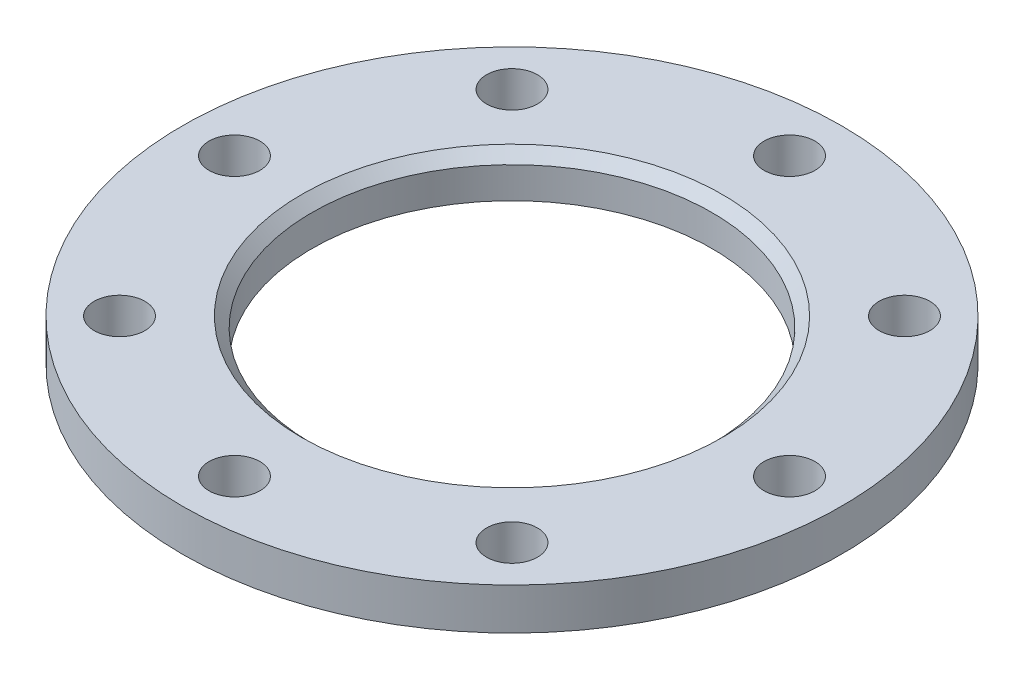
ISO-10303-21;
HEADER;
FILE_DESCRIPTION(('STEP AP214'),'2;1');
FILE_NAME('part.step','',(''),(''),'','','');
FILE_SCHEMA(('AUTOMOTIVE_DESIGN { 1 0 10303 214 1 1 1 1 }'));
ENDSEC;
DATA;
#1=APPLICATION_CONTEXT('core data for automotive mechanical design processes');
#2=APPLICATION_PROTOCOL_DEFINITION('international standard','automotive_design',2000,#1);
#3=PRODUCT_CONTEXT('',#1,'mechanical');
#4=PRODUCT('Part','Part','',(#3));
#5=PRODUCT_RELATED_PRODUCT_CATEGORY('part','',(#4));
#6=PRODUCT_DEFINITION_FORMATION('','',#4);
#7=PRODUCT_DEFINITION_CONTEXT('part definition',#1,'design');
#8=PRODUCT_DEFINITION('design','',#6,#7);
#9=PRODUCT_DEFINITION_SHAPE('','',#8);
#10=(LENGTH_UNIT() NAMED_UNIT(*) SI_UNIT(.MILLI.,.METRE.));
#11=(NAMED_UNIT(*) PLANE_ANGLE_UNIT() SI_UNIT($,.RADIAN.));
#12=(NAMED_UNIT(*) SI_UNIT($,.STERADIAN.) SOLID_ANGLE_UNIT());
#13=UNCERTAINTY_MEASURE_WITH_UNIT(LENGTH_MEASURE(1.E-05),#10,'distance_accuracy_value','');
#14=(GEOMETRIC_REPRESENTATION_CONTEXT(3) GLOBAL_UNCERTAINTY_ASSIGNED_CONTEXT((#13)) GLOBAL_UNIT_ASSIGNED_CONTEXT((#10,
#11,#12)) REPRESENTATION_CONTEXT('',''));
#15=CARTESIAN_POINT('',(0.,0.,0.));
#16=DIRECTION('',(0.,0.,1.));
#17=DIRECTION('',(1.,0.,0.));
#18=AXIS2_PLACEMENT_3D('',#15,#16,#17);
#19=CARTESIAN_POINT('',(116.75,18.,0.));
#20=DIRECTION('',(0.,1.,0.));
#21=DIRECTION('',(0.,0.,1.));
#22=AXIS2_PLACEMENT_3D('',#19,#20,#21);
#23=PLANE('',#22);
#24=CARTESIAN_POINT('',(0.,18.,0.));
#25=DIRECTION('',(0.,1.,0.));
#26=DIRECTION('',(0.,0.,1.));
#27=AXIS2_PLACEMENT_3D('',#24,#25,#26);
#28=CIRCLE('',#27,91.);
#29=CARTESIAN_POINT('',(0.,18.,91.));
#30=VERTEX_POINT('',#29);
#31=EDGE_CURVE('E16',#30,#30,#28,.F.);
#32=ORIENTED_EDGE('',*,*,#31,.T.);
#33=EDGE_LOOP('',(#32));
#34=FACE_BOUND('',#33,.T.);
#35=CARTESIAN_POINT('',(120.,18.,0.));
#36=DIRECTION('',(0.,-1.,0.));
#37=DIRECTION('',(0.,0.,-1.));
#38=AXIS2_PLACEMENT_3D('',#35,#36,#37);
#39=CIRCLE('',#38,11.);
#40=CARTESIAN_POINT('',(120.,18.,-11.));
#41=VERTEX_POINT('',#40);
#42=EDGE_CURVE('E53',#41,#41,#39,.T.);
#43=ORIENTED_EDGE('',*,*,#42,.T.);
#44=EDGE_LOOP('',(#43));
#45=FACE_BOUND('',#44,.T.);
#46=CARTESIAN_POINT('',(84.8528137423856,18.,84.8528137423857));
#47=DIRECTION('',(0.,-1.,0.));
#48=DIRECTION('',(0.,0.,-1.));
#49=AXIS2_PLACEMENT_3D('',#46,#47,#48);
#50=CIRCLE('',#49,11.);
#51=CARTESIAN_POINT('',(84.8528137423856,18.,73.8528137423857));
#52=VERTEX_POINT('',#51);
#53=EDGE_CURVE('E56',#52,#52,#50,.T.);
#54=ORIENTED_EDGE('',*,*,#53,.T.);
#55=EDGE_LOOP('',(#54));
#56=FACE_BOUND('',#55,.T.);
#57=CARTESIAN_POINT('',(0.,18.,120.));
#58=DIRECTION('',(0.,-1.,0.));
#59=DIRECTION('',(0.,0.,-1.));
#60=AXIS2_PLACEMENT_3D('',#57,#58,#59);
#61=CIRCLE('',#60,11.);
#62=CARTESIAN_POINT('',(0.,18.,109.));
#63=VERTEX_POINT('',#62);
#64=EDGE_CURVE('E59',#63,#63,#61,.T.);
#65=ORIENTED_EDGE('',*,*,#64,.T.);
#66=EDGE_LOOP('',(#65));
#67=FACE_BOUND('',#66,.T.);
#68=CARTESIAN_POINT('',(-84.8528137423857,18.,84.8528137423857));
#69=DIRECTION('',(0.,-1.,0.));
#70=DIRECTION('',(0.,0.,-1.));
#71=AXIS2_PLACEMENT_3D('',#68,#69,#70);
#72=CIRCLE('',#71,11.);
#73=CARTESIAN_POINT('',(-84.8528137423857,18.,73.8528137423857));
#74=VERTEX_POINT('',#73);
#75=EDGE_CURVE('E62',#74,#74,#72,.T.);
#76=ORIENTED_EDGE('',*,*,#75,.T.);
#77=EDGE_LOOP('',(#76));
#78=FACE_BOUND('',#77,.T.);
#79=CARTESIAN_POINT('',(-120.,18.,0.));
#80=DIRECTION('',(0.,-1.,0.));
#81=DIRECTION('',(0.,0.,-1.));
#82=AXIS2_PLACEMENT_3D('',#79,#80,#81);
#83=CIRCLE('',#82,11.);
#84=CARTESIAN_POINT('',(-120.,18.,-11.));
#85=VERTEX_POINT('',#84);
#86=EDGE_CURVE('E65',#85,#85,#83,.T.);
#87=ORIENTED_EDGE('',*,*,#86,.T.);
#88=EDGE_LOOP('',(#87));
#89=FACE_BOUND('',#88,.T.);
#90=CARTESIAN_POINT('',(-84.8528137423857,18.,-84.8528137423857));
#91=DIRECTION('',(0.,-1.,0.));
#92=DIRECTION('',(0.,0.,-1.));
#93=AXIS2_PLACEMENT_3D('',#90,#91,#92);
#94=CIRCLE('',#93,11.);
#95=CARTESIAN_POINT('',(-84.8528137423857,18.,-95.8528137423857));
#96=VERTEX_POINT('',#95);
#97=EDGE_CURVE('E68',#96,#96,#94,.T.);
#98=ORIENTED_EDGE('',*,*,#97,.T.);
#99=EDGE_LOOP('',(#98));
#100=FACE_BOUND('',#99,.T.);
#101=CARTESIAN_POINT('',(0.,18.,-120.));
#102=DIRECTION('',(0.,-1.,0.));
#103=DIRECTION('',(0.,0.,-1.));
#104=AXIS2_PLACEMENT_3D('',#101,#102,#103);
#105=CIRCLE('',#104,11.);
#106=CARTESIAN_POINT('',(0.,18.,-131.));
#107=VERTEX_POINT('',#106);
#108=EDGE_CURVE('E71',#107,#107,#105,.T.);
#109=ORIENTED_EDGE('',*,*,#108,.T.);
#110=EDGE_LOOP('',(#109));
#111=FACE_BOUND('',#110,.T.);
#112=CARTESIAN_POINT('',(84.8528137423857,18.,-84.8528137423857));
#113=DIRECTION('',(0.,-1.,0.));
#114=DIRECTION('',(0.,0.,-1.));
#115=AXIS2_PLACEMENT_3D('',#112,#113,#114);
#116=CIRCLE('',#115,11.);
#117=CARTESIAN_POINT('',(84.8528137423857,18.,-95.8528137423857));
#118=VERTEX_POINT('',#117);
#119=EDGE_CURVE('E74',#118,#118,#116,.T.);
#120=ORIENTED_EDGE('',*,*,#119,.T.);
#121=EDGE_LOOP('',(#120));
#122=FACE_BOUND('',#121,.T.);
#123=CARTESIAN_POINT('',(0.,18.,0.));
#124=DIRECTION('',(0.,1.,0.));
#125=DIRECTION('',(0.,0.,1.));
#126=AXIS2_PLACEMENT_3D('',#123,#124,#125);
#127=CIRCLE('',#126,142.5);
#128=CARTESIAN_POINT('',(0.,18.,142.5));
#129=VERTEX_POINT('',#128);
#130=EDGE_CURVE('E76',#129,#129,#127,.F.);
#131=ORIENTED_EDGE('',*,*,#130,.F.);
#132=EDGE_LOOP('',(#131));
#133=FACE_BOUND('',#132,.T.);
#134=ADVANCED_FACE('F13',(#34,#45,#56,#67,#78,#89,#100,#111,#122,#133),#23,.T.);
#135=CARTESIAN_POINT('',(0.,18.,0.));
#136=DIRECTION('',(0.,1.,0.));
#137=DIRECTION('',(0.,0.,1.));
#138=AXIS2_PLACEMENT_3D('',#135,#136,#137);
#139=CONICAL_SURFACE('',#138,91.,0.785398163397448);
#140=ORIENTED_EDGE('',*,*,#31,.F.);
#141=EDGE_LOOP('',(#140));
#142=FACE_BOUND('',#141,.T.);
#143=CARTESIAN_POINT('',(0.,13.5,0.));
#144=DIRECTION('',(0.,1.,0.));
#145=DIRECTION('',(0.,0.,1.));
#146=AXIS2_PLACEMENT_3D('',#143,#144,#145);
#147=CIRCLE('',#146,86.5);
#148=CARTESIAN_POINT('',(0.,13.5,86.5));
#149=VERTEX_POINT('',#148);
#150=EDGE_CURVE('E28',#149,#149,#147,.F.);
#151=ORIENTED_EDGE('',*,*,#150,.T.);
#152=EDGE_LOOP('',(#151));
#153=FACE_BOUND('',#152,.T.);
#154=ADVANCED_FACE('F85',(#142,#153),#139,.F.);
#155=CARTESIAN_POINT('',(0.,9.,0.));
#156=DIRECTION('',(0.,1.,0.));
#157=DIRECTION('',(0.,0.,1.));
#158=AXIS2_PLACEMENT_3D('',#155,#156,#157);
#159=CYLINDRICAL_SURFACE('',#158,142.5);
#160=CARTESIAN_POINT('',(0.,0.,0.));
#161=DIRECTION('',(0.,1.,0.));
#162=DIRECTION('',(0.,0.,1.));
#163=AXIS2_PLACEMENT_3D('',#160,#161,#162);
#164=CIRCLE('',#163,142.5);
#165=CARTESIAN_POINT('',(0.,0.,142.5));
#166=VERTEX_POINT('',#165);
#167=EDGE_CURVE('E50',#166,#166,#164,.F.);
#168=ORIENTED_EDGE('',*,*,#167,.F.);
#169=EDGE_LOOP('',(#168));
#170=FACE_BOUND('',#169,.T.);
#171=ORIENTED_EDGE('',*,*,#130,.T.);
#172=EDGE_LOOP('',(#171));
#173=FACE_BOUND('',#172,.T.);
#174=ADVANCED_FACE('F88',(#170,#173),#159,.T.);
#175=CARTESIAN_POINT('',(84.8528137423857,18.,-84.8528137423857));
#176=DIRECTION('',(0.,-1.,0.));
#177=DIRECTION('',(0.,0.,-1.));
#178=AXIS2_PLACEMENT_3D('',#175,#176,#177);
#179=CYLINDRICAL_SURFACE('',#178,11.);
#180=ORIENTED_EDGE('',*,*,#119,.F.);
#181=EDGE_LOOP('',(#180));
#182=FACE_BOUND('',#181,.T.);
#183=CARTESIAN_POINT('',(84.8528137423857,0.,-84.8528137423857));
#184=DIRECTION('',(0.,-1.,0.));
#185=DIRECTION('',(0.,0.,-1.));
#186=AXIS2_PLACEMENT_3D('',#183,#184,#185);
#187=CIRCLE('',#186,11.);
#188=CARTESIAN_POINT('',(84.8528137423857,0.,-95.8528137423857));
#189=VERTEX_POINT('',#188);
#190=EDGE_CURVE('E47',#189,#189,#187,.F.);
#191=ORIENTED_EDGE('',*,*,#190,.F.);
#192=EDGE_LOOP('',(#191));
#193=FACE_BOUND('',#192,.T.);
#194=ADVANCED_FACE('F130',(#182,#193),#179,.F.);
#195=CARTESIAN_POINT('',(0.,18.,-120.));
#196=DIRECTION('',(0.,-1.,0.));
#197=DIRECTION('',(0.,0.,-1.));
#198=AXIS2_PLACEMENT_3D('',#195,#196,#197);
#199=CYLINDRICAL_SURFACE('',#198,11.);
#200=ORIENTED_EDGE('',*,*,#108,.F.);
#201=EDGE_LOOP('',(#200));
#202=FACE_BOUND('',#201,.T.);
#203=CARTESIAN_POINT('',(0.,0.,-120.));
#204=DIRECTION('',(0.,-1.,0.));
#205=DIRECTION('',(0.,0.,-1.));
#206=AXIS2_PLACEMENT_3D('',#203,#204,#205);
#207=CIRCLE('',#206,11.);
#208=CARTESIAN_POINT('',(0.,0.,-131.));
#209=VERTEX_POINT('',#208);
#210=EDGE_CURVE('E44',#209,#209,#207,.F.);
#211=ORIENTED_EDGE('',*,*,#210,.F.);
#212=EDGE_LOOP('',(#211));
#213=FACE_BOUND('',#212,.T.);
#214=ADVANCED_FACE('F126',(#202,#213),#199,.F.);
#215=CARTESIAN_POINT('',(-84.8528137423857,18.,-84.8528137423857));
#216=DIRECTION('',(0.,-1.,0.));
#217=DIRECTION('',(0.,0.,-1.));
#218=AXIS2_PLACEMENT_3D('',#215,#216,#217);
#219=CYLINDRICAL_SURFACE('',#218,11.);
#220=ORIENTED_EDGE('',*,*,#97,.F.);
#221=EDGE_LOOP('',(#220));
#222=FACE_BOUND('',#221,.T.);
#223=CARTESIAN_POINT('',(-84.8528137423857,0.,-84.8528137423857));
#224=DIRECTION('',(0.,-1.,0.));
#225=DIRECTION('',(0.,0.,-1.));
#226=AXIS2_PLACEMENT_3D('',#223,#224,#225);
#227=CIRCLE('',#226,11.);
#228=CARTESIAN_POINT('',(-84.8528137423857,0.,-95.8528137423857));
#229=VERTEX_POINT('',#228);
#230=EDGE_CURVE('E41',#229,#229,#227,.F.);
#231=ORIENTED_EDGE('',*,*,#230,.F.);
#232=EDGE_LOOP('',(#231));
#233=FACE_BOUND('',#232,.T.);
#234=ADVANCED_FACE('F122',(#222,#233),#219,.F.);
#235=CARTESIAN_POINT('',(-120.,18.,0.));
#236=DIRECTION('',(0.,-1.,0.));
#237=DIRECTION('',(0.,0.,-1.));
#238=AXIS2_PLACEMENT_3D('',#235,#236,#237);
#239=CYLINDRICAL_SURFACE('',#238,11.);
#240=ORIENTED_EDGE('',*,*,#86,.F.);
#241=EDGE_LOOP('',(#240));
#242=FACE_BOUND('',#241,.T.);
#243=CARTESIAN_POINT('',(-120.,0.,0.));
#244=DIRECTION('',(0.,-1.,0.));
#245=DIRECTION('',(0.,0.,-1.));
#246=AXIS2_PLACEMENT_3D('',#243,#244,#245);
#247=CIRCLE('',#246,11.);
#248=CARTESIAN_POINT('',(-120.,0.,-11.));
#249=VERTEX_POINT('',#248);
#250=EDGE_CURVE('E38',#249,#249,#247,.F.);
#251=ORIENTED_EDGE('',*,*,#250,.F.);
#252=EDGE_LOOP('',(#251));
#253=FACE_BOUND('',#252,.T.);
#254=ADVANCED_FACE('F118',(#242,#253),#239,.F.);
#255=CARTESIAN_POINT('',(-84.8528137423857,18.,84.8528137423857));
#256=DIRECTION('',(0.,-1.,0.));
#257=DIRECTION('',(0.,0.,-1.));
#258=AXIS2_PLACEMENT_3D('',#255,#256,#257);
#259=CYLINDRICAL_SURFACE('',#258,11.);
#260=ORIENTED_EDGE('',*,*,#75,.F.);
#261=EDGE_LOOP('',(#260));
#262=FACE_BOUND('',#261,.T.);
#263=CARTESIAN_POINT('',(-84.8528137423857,0.,84.8528137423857));
#264=DIRECTION('',(0.,-1.,0.));
#265=DIRECTION('',(0.,0.,-1.));
#266=AXIS2_PLACEMENT_3D('',#263,#264,#265);
#267=CIRCLE('',#266,11.);
#268=CARTESIAN_POINT('',(-84.8528137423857,0.,73.8528137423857));
#269=VERTEX_POINT('',#268);
#270=EDGE_CURVE('E35',#269,#269,#267,.F.);
#271=ORIENTED_EDGE('',*,*,#270,.F.);
#272=EDGE_LOOP('',(#271));
#273=FACE_BOUND('',#272,.T.);
#274=ADVANCED_FACE('F114',(#262,#273),#259,.F.);
#275=CARTESIAN_POINT('',(0.,18.,120.));
#276=DIRECTION('',(0.,-1.,0.));
#277=DIRECTION('',(0.,0.,-1.));
#278=AXIS2_PLACEMENT_3D('',#275,#276,#277);
#279=CYLINDRICAL_SURFACE('',#278,11.);
#280=ORIENTED_EDGE('',*,*,#64,.F.);
#281=EDGE_LOOP('',(#280));
#282=FACE_BOUND('',#281,.T.);
#283=CARTESIAN_POINT('',(0.,0.,120.));
#284=DIRECTION('',(0.,-1.,0.));
#285=DIRECTION('',(0.,0.,-1.));
#286=AXIS2_PLACEMENT_3D('',#283,#284,#285);
#287=CIRCLE('',#286,11.);
#288=CARTESIAN_POINT('',(0.,0.,109.));
#289=VERTEX_POINT('',#288);
#290=EDGE_CURVE('E32',#289,#289,#287,.F.);
#291=ORIENTED_EDGE('',*,*,#290,.F.);
#292=EDGE_LOOP('',(#291));
#293=FACE_BOUND('',#292,.T.);
#294=ADVANCED_FACE('F110',(#282,#293),#279,.F.);
#295=CARTESIAN_POINT('',(84.8528137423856,18.,84.8528137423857));
#296=DIRECTION('',(0.,-1.,0.));
#297=DIRECTION('',(0.,0.,-1.));
#298=AXIS2_PLACEMENT_3D('',#295,#296,#297);
#299=CYLINDRICAL_SURFACE('',#298,11.);
#300=ORIENTED_EDGE('',*,*,#53,.F.);
#301=EDGE_LOOP('',(#300));
#302=FACE_BOUND('',#301,.T.);
#303=CARTESIAN_POINT('',(84.8528137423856,0.,84.8528137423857));
#304=DIRECTION('',(0.,-1.,0.));
#305=DIRECTION('',(0.,0.,-1.));
#306=AXIS2_PLACEMENT_3D('',#303,#304,#305);
#307=CIRCLE('',#306,11.);
#308=CARTESIAN_POINT('',(84.8528137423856,0.,73.8528137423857));
#309=VERTEX_POINT('',#308);
#310=EDGE_CURVE('E25',#309,#309,#307,.F.);
#311=ORIENTED_EDGE('',*,*,#310,.F.);
#312=EDGE_LOOP('',(#311));
#313=FACE_BOUND('',#312,.T.);
#314=ADVANCED_FACE('F104',(#302,#313),#299,.F.);
#315=CARTESIAN_POINT('',(120.,18.,0.));
#316=DIRECTION('',(0.,-1.,0.));
#317=DIRECTION('',(0.,0.,-1.));
#318=AXIS2_PLACEMENT_3D('',#315,#316,#317);
#319=CYLINDRICAL_SURFACE('',#318,11.);
#320=ORIENTED_EDGE('',*,*,#42,.F.);
#321=EDGE_LOOP('',(#320));
#322=FACE_BOUND('',#321,.T.);
#323=CARTESIAN_POINT('',(120.,0.,0.));
#324=DIRECTION('',(0.,-1.,0.));
#325=DIRECTION('',(0.,0.,-1.));
#326=AXIS2_PLACEMENT_3D('',#323,#324,#325);
#327=CIRCLE('',#326,11.);
#328=CARTESIAN_POINT('',(120.,0.,-11.));
#329=VERTEX_POINT('',#328);
#330=EDGE_CURVE('E20',#329,#329,#327,.F.);
#331=ORIENTED_EDGE('',*,*,#330,.F.);
#332=EDGE_LOOP('',(#331));
#333=FACE_BOUND('',#332,.T.);
#334=ADVANCED_FACE('F96',(#322,#333),#319,.F.);
#335=CARTESIAN_POINT('',(0.,6.75,0.));
#336=DIRECTION('',(0.,1.,0.));
#337=DIRECTION('',(0.,0.,1.));
#338=AXIS2_PLACEMENT_3D('',#335,#336,#337);
#339=CYLINDRICAL_SURFACE('',#338,86.5);
#340=ORIENTED_EDGE('',*,*,#150,.F.);
#341=EDGE_LOOP('',(#340));
#342=FACE_BOUND('',#341,.T.);
#343=CARTESIAN_POINT('',(0.,0.,0.));
#344=DIRECTION('',(0.,1.,0.));
#345=DIRECTION('',(0.,0.,1.));
#346=AXIS2_PLACEMENT_3D('',#343,#344,#345);
#347=CIRCLE('',#346,86.5);
#348=CARTESIAN_POINT('',(0.,0.,86.5));
#349=VERTEX_POINT('',#348);
#350=EDGE_CURVE('E8',#349,#349,#347,.T.);
#351=ORIENTED_EDGE('',*,*,#350,.F.);
#352=EDGE_LOOP('',(#351));
#353=FACE_BOUND('',#352,.T.);
#354=ADVANCED_FACE('F92',(#342,#353),#339,.F.);
#355=CARTESIAN_POINT('',(114.5,0.,0.));
#356=DIRECTION('',(0.,-1.,0.));
#357=DIRECTION('',(0.,0.,-1.));
#358=AXIS2_PLACEMENT_3D('',#355,#356,#357);
#359=PLANE('',#358);
#360=ORIENTED_EDGE('',*,*,#350,.T.);
#361=EDGE_LOOP('',(#360));
#362=FACE_BOUND('',#361,.T.);
#363=ORIENTED_EDGE('',*,*,#330,.T.);
#364=EDGE_LOOP('',(#363));
#365=FACE_BOUND('',#364,.T.);
#366=ORIENTED_EDGE('',*,*,#310,.T.);
#367=EDGE_LOOP('',(#366));
#368=FACE_BOUND('',#367,.T.);
#369=ORIENTED_EDGE('',*,*,#290,.T.);
#370=EDGE_LOOP('',(#369));
#371=FACE_BOUND('',#370,.T.);
#372=ORIENTED_EDGE('',*,*,#270,.T.);
#373=EDGE_LOOP('',(#372));
#374=FACE_BOUND('',#373,.T.);
#375=ORIENTED_EDGE('',*,*,#250,.T.);
#376=EDGE_LOOP('',(#375));
#377=FACE_BOUND('',#376,.T.);
#378=ORIENTED_EDGE('',*,*,#230,.T.);
#379=EDGE_LOOP('',(#378));
#380=FACE_BOUND('',#379,.T.);
#381=ORIENTED_EDGE('',*,*,#210,.T.);
#382=EDGE_LOOP('',(#381));
#383=FACE_BOUND('',#382,.T.);
#384=ORIENTED_EDGE('',*,*,#190,.T.);
#385=EDGE_LOOP('',(#384));
#386=FACE_BOUND('',#385,.T.);
#387=ORIENTED_EDGE('',*,*,#167,.T.);
#388=EDGE_LOOP('',(#387));
#389=FACE_BOUND('',#388,.T.);
#390=ADVANCED_FACE('F95',(#362,#365,#368,#371,#374,#377,#380,#383,#386,#389),#359,.T.);
#391=CLOSED_SHELL('',(#134,#154,#174,#194,#214,#234,#254,#274,#294,#314,#334,#354,#390));
#392=MANIFOLD_SOLID_BREP('B1',#391);
#393=ADVANCED_BREP_SHAPE_REPRESENTATION('',(#18,#392),#14);
#394=SHAPE_DEFINITION_REPRESENTATION(#9,#393);
ENDSEC;
END-ISO-10303-21;
